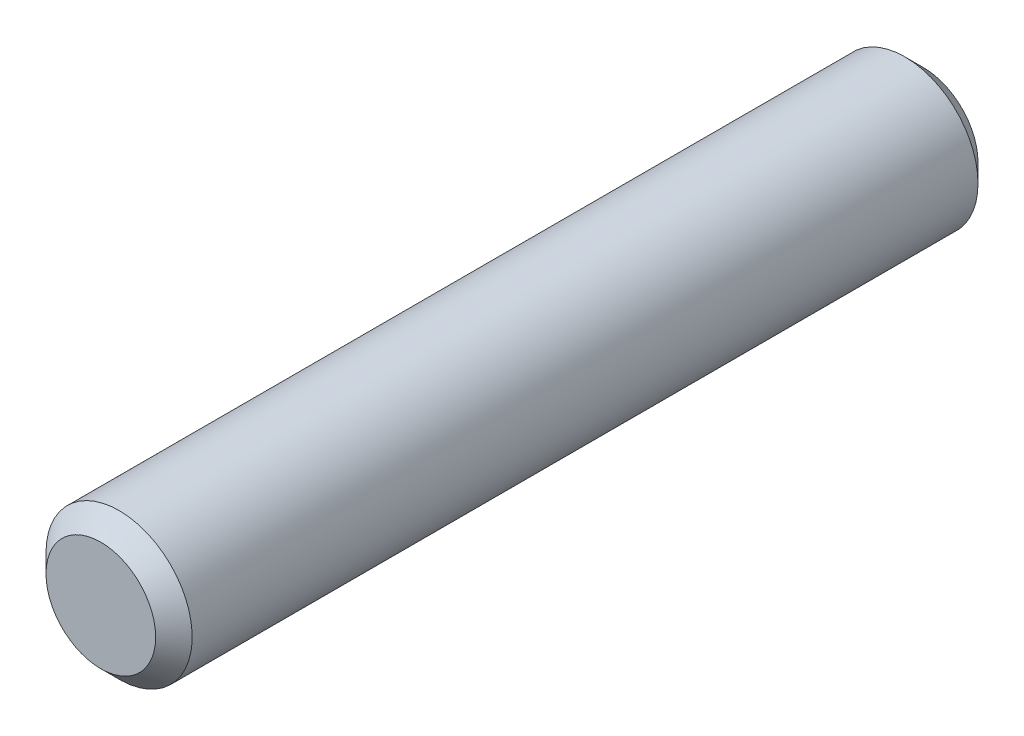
ISO-10303-21;
HEADER;
FILE_DESCRIPTION(('STEP AP214'),'2;1');
FILE_NAME('part.step','',(''),(''),'','','');
FILE_SCHEMA(('AUTOMOTIVE_DESIGN { 1 0 10303 214 1 1 1 1 }'));
ENDSEC;
DATA;
#1=APPLICATION_CONTEXT('core data for automotive mechanical design processes');
#2=APPLICATION_PROTOCOL_DEFINITION('international standard','automotive_design',2000,#1);
#3=PRODUCT_CONTEXT('',#1,'mechanical');
#4=PRODUCT('Part','Part','',(#3));
#5=PRODUCT_RELATED_PRODUCT_CATEGORY('part','',(#4));
#6=PRODUCT_DEFINITION_FORMATION('','',#4);
#7=PRODUCT_DEFINITION_CONTEXT('part definition',#1,'design');
#8=PRODUCT_DEFINITION('design','',#6,#7);
#9=PRODUCT_DEFINITION_SHAPE('','',#8);
#10=(LENGTH_UNIT() NAMED_UNIT(*) SI_UNIT(.MILLI.,.METRE.));
#11=(NAMED_UNIT(*) PLANE_ANGLE_UNIT() SI_UNIT($,.RADIAN.));
#12=(NAMED_UNIT(*) SI_UNIT($,.STERADIAN.) SOLID_ANGLE_UNIT());
#13=UNCERTAINTY_MEASURE_WITH_UNIT(LENGTH_MEASURE(1.E-05),#10,'distance_accuracy_value','');
#14=(GEOMETRIC_REPRESENTATION_CONTEXT(3) GLOBAL_UNCERTAINTY_ASSIGNED_CONTEXT((#13)) GLOBAL_UNIT_ASSIGNED_CONTEXT((#10,
#11,#12)) REPRESENTATION_CONTEXT('',''));
#15=CARTESIAN_POINT('',(0.,0.,0.));
#16=DIRECTION('',(0.,0.,1.));
#17=DIRECTION('',(1.,0.,0.));
#18=AXIS2_PLACEMENT_3D('',#15,#16,#17);
#19=CARTESIAN_POINT('',(0.,0.,45.));
#20=DIRECTION('',(0.,0.,-1.));
#21=DIRECTION('',(-1.,0.,0.));
#22=AXIS2_PLACEMENT_3D('',#19,#20,#21);
#23=CYLINDRICAL_SURFACE('',#22,4.);
#24=CARTESIAN_POINT('',(0.,0.,1.00000000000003));
#25=DIRECTION('',(0.,0.,1.));
#26=DIRECTION('',(1.,0.,0.));
#27=AXIS2_PLACEMENT_3D('',#24,#25,#26);
#28=CIRCLE('',#27,4.);
#29=CARTESIAN_POINT('',(-4.,0.,1.00000000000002));
#30=VERTEX_POINT('',#29);
#31=EDGE_CURVE('E41',#30,#30,#28,.T.);
#32=CARTESIAN_POINT('',(0.,0.,44.));
#33=DIRECTION('',(0.,0.,1.));
#34=DIRECTION('',(1.,0.,0.));
#35=AXIS2_PLACEMENT_3D('',#32,#33,#34);
#36=CIRCLE('',#35,4.);
#37=CARTESIAN_POINT('',(-4.,0.,44.));
#38=VERTEX_POINT('',#37);
#39=EDGE_CURVE('E45',#38,#38,#36,.F.);
#40=CARTESIAN_POINT('',(-4.,0.,1.00000000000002));
#41=CARTESIAN_POINT('',(-4.,0.,1.44791666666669));
#42=CARTESIAN_POINT('',(-4.,0.,1.89583333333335));
#43=CARTESIAN_POINT('',(-4.,0.,2.79166666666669));
#44=CARTESIAN_POINT('',(-4.,0.,3.23958333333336));
#45=CARTESIAN_POINT('',(-4.,0.,4.13541666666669));
#46=CARTESIAN_POINT('',(-4.,0.,4.58333333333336));
#47=CARTESIAN_POINT('',(-4.,0.,5.47916666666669));
#48=CARTESIAN_POINT('',(-4.,0.,5.92708333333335));
#49=CARTESIAN_POINT('',(-4.,0.,6.82291666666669));
#50=CARTESIAN_POINT('',(-4.,0.,7.27083333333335));
#51=CARTESIAN_POINT('',(-4.,0.,8.16666666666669));
#52=CARTESIAN_POINT('',(-4.,0.,8.61458333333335));
#53=CARTESIAN_POINT('',(-4.,0.,9.51041666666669));
#54=CARTESIAN_POINT('',(-4.,0.,9.95833333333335));
#55=CARTESIAN_POINT('',(-4.,0.,10.8541666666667));
#56=CARTESIAN_POINT('',(-4.,0.,11.3020833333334));
#57=CARTESIAN_POINT('',(-4.,0.,12.1979166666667));
#58=CARTESIAN_POINT('',(-4.,0.,12.6458333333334));
#59=CARTESIAN_POINT('',(-4.,0.,13.5416666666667));
#60=CARTESIAN_POINT('',(-4.,0.,13.9895833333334));
#61=CARTESIAN_POINT('',(-4.,0.,14.8854166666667));
#62=CARTESIAN_POINT('',(-4.,0.,15.3333333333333));
#63=CARTESIAN_POINT('',(-4.,0.,16.2291666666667));
#64=CARTESIAN_POINT('',(-4.,0.,16.6770833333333));
#65=CARTESIAN_POINT('',(-4.,0.,17.5729166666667));
#66=CARTESIAN_POINT('',(-4.,0.,18.0208333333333));
#67=CARTESIAN_POINT('',(-4.,0.,18.9166666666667));
#68=CARTESIAN_POINT('',(-4.,0.,19.3645833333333));
#69=CARTESIAN_POINT('',(-4.,0.,20.2604166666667));
#70=CARTESIAN_POINT('',(-4.,0.,20.7083333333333));
#71=CARTESIAN_POINT('',(-4.,0.,21.6041666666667));
#72=CARTESIAN_POINT('',(-4.,0.,22.0520833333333));
#73=CARTESIAN_POINT('',(-4.,0.,22.9479166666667));
#74=CARTESIAN_POINT('',(-4.,0.,23.3958333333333));
#75=CARTESIAN_POINT('',(-4.,0.,24.2916666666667));
#76=CARTESIAN_POINT('',(-4.,0.,24.7395833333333));
#77=CARTESIAN_POINT('',(-4.,0.,25.6354166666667));
#78=CARTESIAN_POINT('',(-4.,0.,26.0833333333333));
#79=CARTESIAN_POINT('',(-4.,0.,26.9791666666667));
#80=CARTESIAN_POINT('',(-4.,0.,27.4270833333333));
#81=CARTESIAN_POINT('',(-4.,0.,28.3229166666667));
#82=CARTESIAN_POINT('',(-4.,0.,28.7708333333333));
#83=CARTESIAN_POINT('',(-4.,0.,29.6666666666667));
#84=CARTESIAN_POINT('',(-4.,0.,30.1145833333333));
#85=CARTESIAN_POINT('',(-4.,0.,31.0104166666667));
#86=CARTESIAN_POINT('',(-4.,0.,31.4583333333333));
#87=CARTESIAN_POINT('',(-4.,0.,32.3541666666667));
#88=CARTESIAN_POINT('',(-4.,0.,32.8020833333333));
#89=CARTESIAN_POINT('',(-4.,0.,33.6979166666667));
#90=CARTESIAN_POINT('',(-4.,0.,34.1458333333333));
#91=CARTESIAN_POINT('',(-4.,0.,35.0416666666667));
#92=CARTESIAN_POINT('',(-4.,0.,35.4895833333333));
#93=CARTESIAN_POINT('',(-4.,0.,36.3854166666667));
#94=CARTESIAN_POINT('',(-4.,0.,36.8333333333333));
#95=CARTESIAN_POINT('',(-4.,0.,37.7291666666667));
#96=CARTESIAN_POINT('',(-4.,0.,38.1770833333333));
#97=CARTESIAN_POINT('',(-4.,0.,39.0729166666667));
#98=CARTESIAN_POINT('',(-4.,0.,39.5208333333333));
#99=CARTESIAN_POINT('',(-4.,0.,40.4166666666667));
#100=CARTESIAN_POINT('',(-4.,0.,40.8645833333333));
#101=CARTESIAN_POINT('',(-4.,0.,41.7604166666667));
#102=CARTESIAN_POINT('',(-4.,0.,42.2083333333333));
#103=CARTESIAN_POINT('',(-4.,0.,43.1041666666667));
#104=CARTESIAN_POINT('',(-4.,0.,43.5520833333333));
#105=CARTESIAN_POINT('',(-4.,0.,44.));
#106=B_SPLINE_CURVE_WITH_KNOTS('',3,(#40,#41,#42,#43,#44,#45,#46,#47,#48,#49,#50,#51,#52,#53,
#54,#55,#56,#57,#58,#59,#60,#61,#62,#63,#64,#65,#66,#67,#68,#69,#70,#71,#72,#73,#74,#75,#76,#77,
#78,#79,#80,#81,#82,#83,#84,#85,#86,#87,#88,#89,#90,#91,#92,#93,#94,#95,#96,#97,#98,#99,#100,
#101,#102,#103,#104,#105),.UNSPECIFIED.,.F.,.F.,(4,2,2,2,2,2,2,2,2,2,2,2,2,2,2,2,2,2,2,2,2,2,2,
2,2,2,2,2,2,2,2,2,4),(0.,1.34375,2.6875,4.03125,5.375,6.71875,8.0625,9.40625,10.75,12.09375,
13.4375,14.78125,16.125,17.46875,18.8125,20.15625,21.5,22.84375,24.1875,25.53125,26.875,
28.21875,29.5625,30.90625,32.25,33.59375,34.9375,36.28125,37.625,38.96875,40.3125,41.65625,43.),.UNSPECIFIED.);
#107=EDGE_CURVE('BSEAM30',#30,#38,#106,.T.);
#108=ORIENTED_EDGE('',*,*,#31,.T.);
#109=ORIENTED_EDGE('',*,*,#39,.T.);
#110=ORIENTED_EDGE('',*,*,#107,.T.);
#111=ORIENTED_EDGE('',*,*,#107,.F.);
#112=EDGE_LOOP('',(#108,#110,#109,#111));
#113=FACE_BOUND('',#112,.T.);
#114=ADVANCED_FACE('F30',(#113),#23,.T.);
#115=CARTESIAN_POINT('',(0.,0.,45.));
#116=DIRECTION('',(0.,0.,1.));
#117=DIRECTION('',(1.,0.,0.));
#118=AXIS2_PLACEMENT_3D('',#115,#116,#117);
#119=PLANE('',#118);
#120=CARTESIAN_POINT('',(0.,0.,45.));
#121=DIRECTION('',(0.,0.,1.));
#122=DIRECTION('',(1.,0.,0.));
#123=AXIS2_PLACEMENT_3D('',#120,#121,#122);
#124=CIRCLE('',#123,3.00000000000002);
#125=CARTESIAN_POINT('',(3.00000000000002,0.,45.));
#126=VERTEX_POINT('',#125);
#127=EDGE_CURVE('E10',#126,#126,#124,.T.);
#128=ORIENTED_EDGE('',*,*,#127,.T.);
#129=EDGE_LOOP('',(#128));
#130=FACE_BOUND('',#129,.T.);
#131=ADVANCED_FACE('F61',(#130),#119,.T.);
#132=CARTESIAN_POINT('',(0.,0.,0.));
#133=DIRECTION('',(0.,0.,1.));
#134=DIRECTION('',(1.,0.,0.));
#135=AXIS2_PLACEMENT_3D('',#132,#133,#134);
#136=PLANE('',#135);
#137=CARTESIAN_POINT('',(0.,0.,0.));
#138=DIRECTION('',(0.,0.,1.));
#139=DIRECTION('',(1.,0.,0.));
#140=AXIS2_PLACEMENT_3D('',#137,#138,#139);
#141=CIRCLE('',#140,2.99999999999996);
#142=CARTESIAN_POINT('',(2.99999999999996,0.,0.));
#143=VERTEX_POINT('',#142);
#144=EDGE_CURVE('E37',#143,#143,#141,.F.);
#145=ORIENTED_EDGE('',*,*,#144,.T.);
#146=EDGE_LOOP('',(#145));
#147=FACE_BOUND('',#146,.T.);
#148=ADVANCED_FACE('F58',(#147),#136,.F.);
#149=CARTESIAN_POINT('',(0.,0.,1.00000000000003));
#150=DIRECTION('',(0.,0.,1.));
#151=DIRECTION('',(1.,0.,0.));
#152=AXIS2_PLACEMENT_3D('',#149,#150,#151);
#153=CONICAL_SURFACE('',#152,4.,0.785398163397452);
#154=ORIENTED_EDGE('',*,*,#144,.F.);
#155=EDGE_LOOP('',(#154));
#156=FACE_BOUND('',#155,.T.);
#157=ORIENTED_EDGE('',*,*,#31,.F.);
#158=EDGE_LOOP('',(#157));
#159=FACE_BOUND('',#158,.T.);
#160=ADVANCED_FACE('F54',(#156,#159),#153,.T.);
#161=CARTESIAN_POINT('',(0.,0.,45.));
#162=DIRECTION('',(0.,0.,-1.));
#163=DIRECTION('',(-1.,0.,0.));
#164=AXIS2_PLACEMENT_3D('',#161,#162,#163);
#165=CONICAL_SURFACE('',#164,3.00000000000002,0.785398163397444);
#166=ORIENTED_EDGE('',*,*,#39,.F.);
#167=EDGE_LOOP('',(#166));
#168=FACE_BOUND('',#167,.T.);
#169=ORIENTED_EDGE('',*,*,#127,.F.);
#170=EDGE_LOOP('',(#169));
#171=FACE_BOUND('',#170,.T.);
#172=ADVANCED_FACE('F32',(#168,#171),#165,.T.);
#173=CLOSED_SHELL('',(#114,#131,#148,#160,#172));
#174=MANIFOLD_SOLID_BREP('B2',#173);
#175=ADVANCED_BREP_SHAPE_REPRESENTATION('',(#18,#174),#14);
#176=SHAPE_DEFINITION_REPRESENTATION(#9,#175);
ENDSEC;
END-ISO-10303-21;
